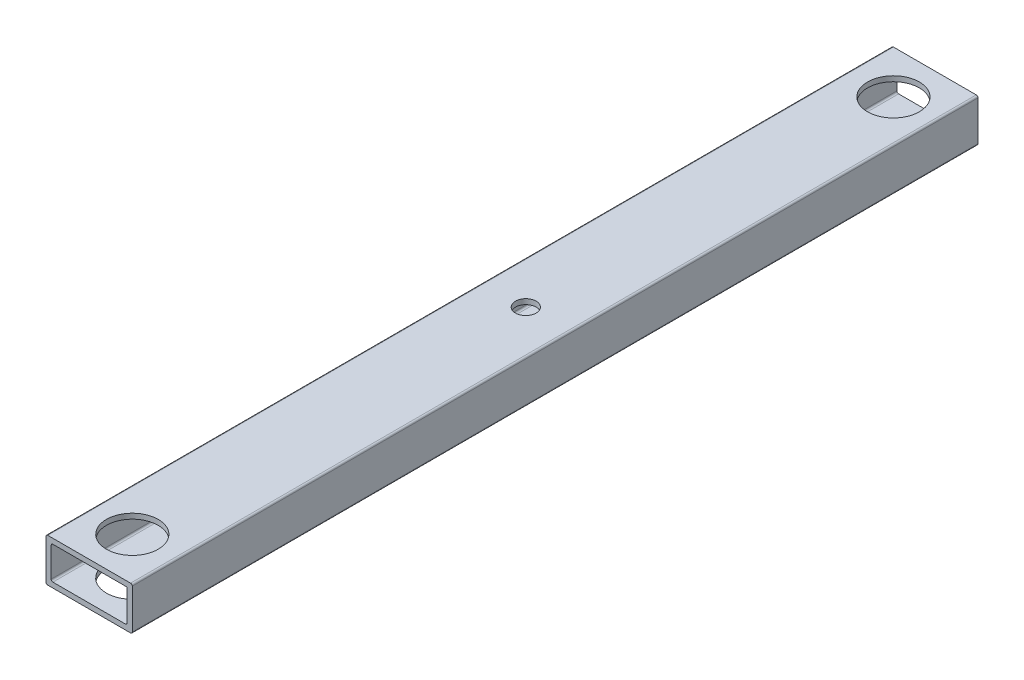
from build123d import *

# Parameters (mm, degrees)
EXTRUSION1_DEPTH        = 490
ESQUISSE2_R             = 15
ESQUISSE2_R_2           = 6
ENL_V_MAT_EXTRU_1_DEPTH = 494.178466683


with BuildPart() as part:
    # Esquisse1 → Extrusion1 (new body)
    with BuildSketch(Plane.XY):
        with BuildLine():
            Line((1, 0), (49, 0))
            ThreePointArc((49, 0), (49.707106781, 0.292893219), (50, 1))
            Line((50, 1), (50, 24))
            ThreePointArc((50, 24), (49.707106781, 24.707106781), (49, 25))
            Line((49, 25), (1, 25))
            ThreePointArc((1, 25), (0.292893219, 24.707106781), (0, 24))
            Line((0, 24), (0, 1))
            ThreePointArc((0, 1), (0.292893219, 0.292893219), (1, 0))
        make_face()
        with BuildLine():
            Line((3, 4), (3, 21))
            ThreePointArc((3, 21), (3.292893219, 21.707106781), (4, 22))
            Line((4, 22), (47, 22))
            Line((47, 22), (47, 4))
            ThreePointArc((47, 4), (46.707106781, 3.292893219), (46, 3))
            Line((46, 3), (4, 3))
            ThreePointArc((4, 3), (3.292893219, 3.292893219), (3, 4))
        make_face(mode=Mode.SUBTRACT)
    extrude(amount=EXTRUSION1_DEPTH)

    # Esquisse2 → Enl_v. mat.-Extru.1 (cut, through all)
    with BuildSketch(Plane(origin=(0, 25, 0), x_dir=(-1, 0, 0), z_dir=(0, 1, 0))):
        with Locations(Location((-26, 25, 0), (0, 0, 90))):
            Circle(ESQUISSE2_R)
        with Locations(Location((-25, 237, 0), (0, 0, 90))):
            Circle(ESQUISSE2_R_2)
        with Locations(Location((-25, 465, 0), (0, 0, 90))):
            Circle(ESQUISSE2_R)
    extrude(amount=-ENL_V_MAT_EXTRU_1_DEPTH, mode=Mode.SUBTRACT)


solid = part.part
